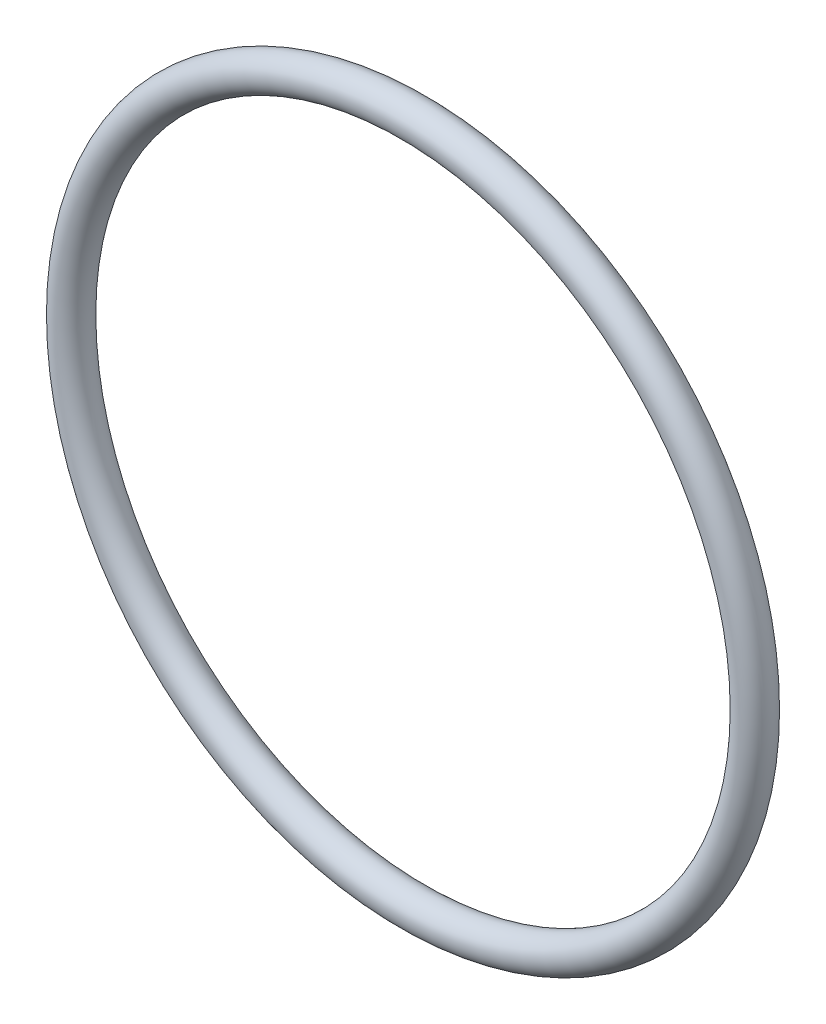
ISO-10303-21;
HEADER;
FILE_DESCRIPTION(('STEP AP214'),'2;1');
FILE_NAME('part.step','',(''),(''),'','','');
FILE_SCHEMA(('AUTOMOTIVE_DESIGN { 1 0 10303 214 1 1 1 1 }'));
ENDSEC;
DATA;
#1=APPLICATION_CONTEXT('core data for automotive mechanical design processes');
#2=APPLICATION_PROTOCOL_DEFINITION('international standard','automotive_design',2000,#1);
#3=PRODUCT_CONTEXT('',#1,'mechanical');
#4=PRODUCT('Part','Part','',(#3));
#5=PRODUCT_RELATED_PRODUCT_CATEGORY('part','',(#4));
#6=PRODUCT_DEFINITION_FORMATION('','',#4);
#7=PRODUCT_DEFINITION_CONTEXT('part definition',#1,'design');
#8=PRODUCT_DEFINITION('design','',#6,#7);
#9=PRODUCT_DEFINITION_SHAPE('','',#8);
#10=(LENGTH_UNIT() NAMED_UNIT(*) SI_UNIT(.MILLI.,.METRE.));
#11=(NAMED_UNIT(*) PLANE_ANGLE_UNIT() SI_UNIT($,.RADIAN.));
#12=(NAMED_UNIT(*) SI_UNIT($,.STERADIAN.) SOLID_ANGLE_UNIT());
#13=UNCERTAINTY_MEASURE_WITH_UNIT(LENGTH_MEASURE(1.E-05),#10,'distance_accuracy_value','');
#14=(GEOMETRIC_REPRESENTATION_CONTEXT(3) GLOBAL_UNCERTAINTY_ASSIGNED_CONTEXT((#13)) GLOBAL_UNIT_ASSIGNED_CONTEXT((#10,
#11,#12)) REPRESENTATION_CONTEXT('',''));
#15=CARTESIAN_POINT('',(0.,0.,0.));
#16=DIRECTION('',(0.,0.,1.));
#17=DIRECTION('',(1.,0.,0.));
#18=AXIS2_PLACEMENT_3D('',#15,#16,#17);
#19=CARTESIAN_POINT('',(0.,0.,0.));
#20=DIRECTION('',(0.,0.,1.));
#21=DIRECTION('',(1.,0.,0.));
#22=AXIS2_PLACEMENT_3D('',#19,#20,#21);
#23=TOROIDAL_SURFACE('',#22,17.4117,0.889);
#24=CARTESIAN_POINT('',(18.3007,0.,0.));
#25=VERTEX_POINT('',#24);
#26=VERTEX_LOOP('',#25);
#27=FACE_BOUND('',#26,.T.);
#28=ADVANCED_FACE('F27',(#27),#23,.T.);
#29=CLOSED_SHELL('',(#28));
#30=MANIFOLD_SOLID_BREP('B2',#29);
#31=ADVANCED_BREP_SHAPE_REPRESENTATION('',(#18,#30),#14);
#32=SHAPE_DEFINITION_REPRESENTATION(#9,#31);
ENDSEC;
END-ISO-10303-21;
